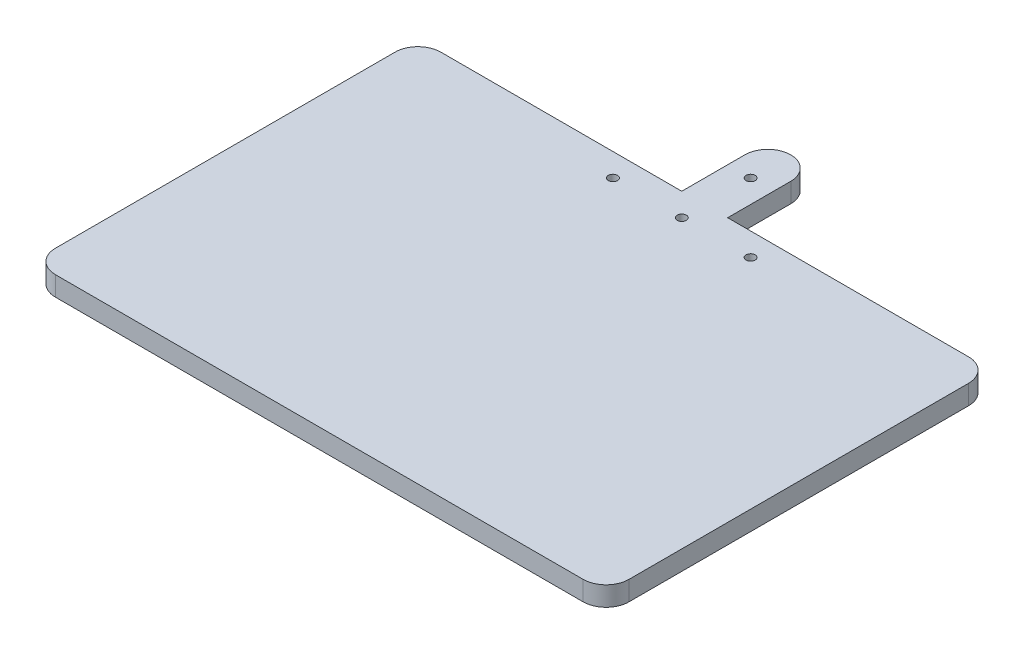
ISO-10303-21;
HEADER;
FILE_DESCRIPTION(('STEP AP214'),'2;1');
FILE_NAME('part.step','',(''),(''),'','','');
FILE_SCHEMA(('AUTOMOTIVE_DESIGN { 1 0 10303 214 1 1 1 1 }'));
ENDSEC;
DATA;
#1=APPLICATION_CONTEXT('core data for automotive mechanical design processes');
#2=APPLICATION_PROTOCOL_DEFINITION('international standard','automotive_design',2000,#1);
#3=PRODUCT_CONTEXT('',#1,'mechanical');
#4=PRODUCT('Part','Part','',(#3));
#5=PRODUCT_RELATED_PRODUCT_CATEGORY('part','',(#4));
#6=PRODUCT_DEFINITION_FORMATION('','',#4);
#7=PRODUCT_DEFINITION_CONTEXT('part definition',#1,'design');
#8=PRODUCT_DEFINITION('design','',#6,#7);
#9=PRODUCT_DEFINITION_SHAPE('','',#8);
#10=(LENGTH_UNIT() NAMED_UNIT(*) SI_UNIT(.MILLI.,.METRE.));
#11=(NAMED_UNIT(*) PLANE_ANGLE_UNIT() SI_UNIT($,.RADIAN.));
#12=(NAMED_UNIT(*) SI_UNIT($,.STERADIAN.) SOLID_ANGLE_UNIT());
#13=UNCERTAINTY_MEASURE_WITH_UNIT(LENGTH_MEASURE(1.E-05),#10,'distance_accuracy_value','');
#14=(GEOMETRIC_REPRESENTATION_CONTEXT(3) GLOBAL_UNCERTAINTY_ASSIGNED_CONTEXT((#13)) GLOBAL_UNIT_ASSIGNED_CONTEXT((#10,
#11,#12)) REPRESENTATION_CONTEXT('',''));
#15=CARTESIAN_POINT('',(0.,0.,0.));
#16=DIRECTION('',(0.,0.,1.));
#17=DIRECTION('',(1.,0.,0.));
#18=AXIS2_PLACEMENT_3D('',#15,#16,#17);
#19=CARTESIAN_POINT('',(0.,-8.5,-87.4904896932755));
#20=DIRECTION('',(0.,-1.,0.));
#21=DIRECTION('',(0.,0.,-1.));
#22=AXIS2_PLACEMENT_3D('',#19,#20,#21);
#23=CYLINDRICAL_SURFACE('',#22,1.99999999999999);
#24=CARTESIAN_POINT('',(0.,0.,-87.4904896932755));
#25=DIRECTION('',(0.,-1.,0.));
#26=DIRECTION('',(0.,0.,-1.));
#27=AXIS2_PLACEMENT_3D('',#24,#25,#26);
#28=CIRCLE('',#27,2.);
#29=CARTESIAN_POINT('',(0.,0.,-89.4904896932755));
#30=VERTEX_POINT('',#29);
#31=EDGE_CURVE('E184',#30,#30,#28,.T.);
#32=ORIENTED_EDGE('',*,*,#31,.F.);
#33=EDGE_LOOP('',(#32));
#34=FACE_BOUND('',#33,.T.);
#35=CARTESIAN_POINT('',(0.,-6.00000000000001,-87.4904896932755));
#36=DIRECTION('',(0.,-1.,0.));
#37=DIRECTION('',(0.,0.,-1.));
#38=AXIS2_PLACEMENT_3D('',#35,#36,#37);
#39=CIRCLE('',#38,1.99999999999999);
#40=CARTESIAN_POINT('',(0.,-6.00000000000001,-89.4904896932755));
#41=VERTEX_POINT('',#40);
#42=EDGE_CURVE('E74',#41,#41,#39,.F.);
#43=ORIENTED_EDGE('',*,*,#42,.F.);
#44=EDGE_LOOP('',(#43));
#45=FACE_BOUND('',#44,.T.);
#46=ADVANCED_FACE('F70',(#34,#45),#23,.F.);
#47=CARTESIAN_POINT('',(30.,-8.5,-57.4904896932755));
#48=DIRECTION('',(0.,-1.,0.));
#49=DIRECTION('',(0.,0.,-1.));
#50=AXIS2_PLACEMENT_3D('',#47,#48,#49);
#51=CYLINDRICAL_SURFACE('',#50,1.99999999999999);
#52=CARTESIAN_POINT('',(30.,0.,-57.4904896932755));
#53=DIRECTION('',(0.,-1.,0.));
#54=DIRECTION('',(0.,0.,-1.));
#55=AXIS2_PLACEMENT_3D('',#52,#53,#54);
#56=CIRCLE('',#55,1.99999999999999);
#57=CARTESIAN_POINT('',(30.,0.,-59.4904896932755));
#58=VERTEX_POINT('',#57);
#59=EDGE_CURVE('E280',#58,#58,#56,.T.);
#60=ORIENTED_EDGE('',*,*,#59,.F.);
#61=EDGE_LOOP('',(#60));
#62=FACE_BOUND('',#61,.T.);
#63=CARTESIAN_POINT('',(30.,-6.00000000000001,-57.4904896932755));
#64=DIRECTION('',(0.,-1.,0.));
#65=DIRECTION('',(0.,0.,-1.));
#66=AXIS2_PLACEMENT_3D('',#63,#64,#65);
#67=CIRCLE('',#66,1.99999999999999);
#68=CARTESIAN_POINT('',(30.,-6.00000000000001,-59.4904896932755));
#69=VERTEX_POINT('',#68);
#70=EDGE_CURVE('E266',#69,#69,#67,.F.);
#71=ORIENTED_EDGE('',*,*,#70,.F.);
#72=EDGE_LOOP('',(#71));
#73=FACE_BOUND('',#72,.T.);
#74=ADVANCED_FACE('F294',(#62,#73),#51,.F.);
#75=CARTESIAN_POINT('',(0.,-8.5,-57.4904896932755));
#76=DIRECTION('',(0.,-1.,0.));
#77=DIRECTION('',(0.,0.,-1.));
#78=AXIS2_PLACEMENT_3D('',#75,#76,#77);
#79=CYLINDRICAL_SURFACE('',#78,1.99999999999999);
#80=CARTESIAN_POINT('',(0.,0.,-57.4904896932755));
#81=DIRECTION('',(0.,-1.,0.));
#82=DIRECTION('',(0.,0.,-1.));
#83=AXIS2_PLACEMENT_3D('',#80,#81,#82);
#84=CIRCLE('',#83,2.);
#85=CARTESIAN_POINT('',(0.,0.,-59.4904896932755));
#86=VERTEX_POINT('',#85);
#87=EDGE_CURVE('E275',#86,#86,#84,.T.);
#88=ORIENTED_EDGE('',*,*,#87,.F.);
#89=EDGE_LOOP('',(#88));
#90=FACE_BOUND('',#89,.T.);
#91=CARTESIAN_POINT('',(0.,-6.00000000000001,-57.4904896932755));
#92=DIRECTION('',(0.,-1.,0.));
#93=DIRECTION('',(0.,0.,-1.));
#94=AXIS2_PLACEMENT_3D('',#91,#92,#93);
#95=CIRCLE('',#94,1.99999999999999);
#96=CARTESIAN_POINT('',(0.,-6.00000000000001,-59.4904896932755));
#97=VERTEX_POINT('',#96);
#98=EDGE_CURVE('E263',#97,#97,#95,.F.);
#99=ORIENTED_EDGE('',*,*,#98,.F.);
#100=EDGE_LOOP('',(#99));
#101=FACE_BOUND('',#100,.T.);
#102=ADVANCED_FACE('F299',(#90,#101),#79,.F.);
#103=CARTESIAN_POINT('',(-30.,-8.5,-57.4904896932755));
#104=DIRECTION('',(0.,-1.,0.));
#105=DIRECTION('',(0.,0.,-1.));
#106=AXIS2_PLACEMENT_3D('',#103,#104,#105);
#107=CYLINDRICAL_SURFACE('',#106,1.99999999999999);
#108=CARTESIAN_POINT('',(-30.,0.,-57.4904896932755));
#109=DIRECTION('',(0.,-1.,0.));
#110=DIRECTION('',(0.,0.,-1.));
#111=AXIS2_PLACEMENT_3D('',#108,#109,#110);
#112=CIRCLE('',#111,2.);
#113=CARTESIAN_POINT('',(-30.,0.,-59.4904896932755));
#114=VERTEX_POINT('',#113);
#115=EDGE_CURVE('E271',#114,#114,#112,.T.);
#116=ORIENTED_EDGE('',*,*,#115,.F.);
#117=EDGE_LOOP('',(#116));
#118=FACE_BOUND('',#117,.T.);
#119=CARTESIAN_POINT('',(-30.,-6.00000000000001,-57.4904896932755));
#120=DIRECTION('',(0.,-1.,0.));
#121=DIRECTION('',(0.,0.,-1.));
#122=AXIS2_PLACEMENT_3D('',#119,#120,#121);
#123=CIRCLE('',#122,1.99999999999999);
#124=CARTESIAN_POINT('',(-30.,-6.00000000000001,-59.4904896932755));
#125=VERTEX_POINT('',#124);
#126=EDGE_CURVE('E260',#125,#125,#123,.F.);
#127=ORIENTED_EDGE('',*,*,#126,.F.);
#128=EDGE_LOOP('',(#127));
#129=FACE_BOUND('',#128,.T.);
#130=ADVANCED_FACE('F324',(#118,#129),#107,.F.);
#131=CARTESIAN_POINT('',(-115.,-309.704249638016,-67.4904896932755));
#132=DIRECTION('',(0.,0.,-1.));
#133=DIRECTION('',(-1.,0.,0.));
#134=AXIS2_PLACEMENT_3D('',#131,#132,#133);
#135=PLANE('',#134);
#136=DIRECTION('',(1.,0.,0.));
#137=VECTOR('',#136,1.);
#138=CARTESIAN_POINT('',(-115.,-8.50000000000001,-67.4904896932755));
#139=LINE('',#138,#137);
#140=CARTESIAN_POINT('',(10.,-8.50000000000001,-67.4904896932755));
#141=VERTEX_POINT('',#140);
#142=CARTESIAN_POINT('',(115.,-8.50000000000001,-67.4904896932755));
#143=VERTEX_POINT('',#142);
#144=EDGE_CURVE('E188',#141,#143,#139,.T.);
#145=ORIENTED_EDGE('',*,*,#144,.F.);
#146=DIRECTION('',(0.,-1.,0.));
#147=VECTOR('',#146,1.);
#148=CARTESIAN_POINT('',(10.,0.,-67.4904896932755));
#149=LINE('',#148,#147);
#150=CARTESIAN_POINT('',(9.99999999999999,0.,-67.4904896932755));
#151=VERTEX_POINT('',#150);
#152=EDGE_CURVE('E181',#151,#141,#149,.T.);
#153=ORIENTED_EDGE('',*,*,#152,.F.);
#154=DIRECTION('',(-1.,0.,0.));
#155=VECTOR('',#154,1.);
#156=CARTESIAN_POINT('',(-115.,0.,-67.4904896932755));
#157=LINE('',#156,#155);
#158=CARTESIAN_POINT('',(115.,0.,-67.4904896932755));
#159=VERTEX_POINT('',#158);
#160=EDGE_CURVE('E163',#159,#151,#157,.T.);
#161=ORIENTED_EDGE('',*,*,#160,.F.);
#162=DIRECTION('',(0.,1.,0.));
#163=VECTOR('',#162,1.);
#164=CARTESIAN_POINT('',(115.,-309.704249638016,-67.4904896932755));
#165=LINE('',#164,#163);
#166=EDGE_CURVE('E242',#143,#159,#165,.T.);
#167=ORIENTED_EDGE('',*,*,#166,.F.);
#168=EDGE_LOOP('',(#145,#153,#161,#167));
#169=FACE_BOUND('',#168,.T.);
#170=ADVANCED_FACE('F187',(#169),#135,.T.);
#171=CARTESIAN_POINT('',(-10.,0.,-67.4904896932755));
#172=VERTEX_POINT('',#171);
#173=CARTESIAN_POINT('',(-115.,0.,-67.4904896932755));
#174=VERTEX_POINT('',#173);
#175=EDGE_CURVE('E175',#172,#174,#157,.T.);
#176=ORIENTED_EDGE('',*,*,#175,.F.);
#177=DIRECTION('',(0.,1.,0.));
#178=VECTOR('',#177,1.);
#179=CARTESIAN_POINT('',(-10.,0.,-67.4904896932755));
#180=LINE('',#179,#178);
#181=CARTESIAN_POINT('',(-9.99999999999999,-8.50000000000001,-67.4904896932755));
#182=VERTEX_POINT('',#181);
#183=EDGE_CURVE('E189',#182,#172,#180,.T.);
#184=ORIENTED_EDGE('',*,*,#183,.F.);
#185=CARTESIAN_POINT('',(-115.,-8.50000000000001,-67.4904896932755));
#186=VERTEX_POINT('',#185);
#187=EDGE_CURVE('E209',#186,#182,#139,.T.);
#188=ORIENTED_EDGE('',*,*,#187,.F.);
#189=DIRECTION('',(0.,1.,0.));
#190=VECTOR('',#189,1.);
#191=CARTESIAN_POINT('',(-115.,-309.704249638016,-67.4904896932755));
#192=LINE('',#191,#190);
#193=EDGE_CURVE('E239',#186,#174,#192,.T.);
#194=ORIENTED_EDGE('',*,*,#193,.T.);
#195=EDGE_LOOP('',(#176,#184,#188,#194));
#196=FACE_BOUND('',#195,.T.);
#197=ADVANCED_FACE('F323',(#196),#135,.T.);
#198=CARTESIAN_POINT('',(12.5,0.,-47.49));
#199=DIRECTION('',(0.,-1.,0.));
#200=DIRECTION('',(0.,0.,-1.));
#201=AXIS2_PLACEMENT_3D('',#198,#199,#200);
#202=PLANE('',#201);
#203=ORIENTED_EDGE('',*,*,#115,.T.);
#204=EDGE_LOOP('',(#203));
#205=FACE_BOUND('',#204,.T.);
#206=ORIENTED_EDGE('',*,*,#87,.T.);
#207=EDGE_LOOP('',(#206));
#208=FACE_BOUND('',#207,.T.);
#209=ORIENTED_EDGE('',*,*,#59,.T.);
#210=EDGE_LOOP('',(#209));
#211=FACE_BOUND('',#210,.T.);
#212=ORIENTED_EDGE('',*,*,#31,.T.);
#213=EDGE_LOOP('',(#212));
#214=FACE_BOUND('',#213,.T.);
#215=ORIENTED_EDGE('',*,*,#160,.T.);
#216=DIRECTION('',(0.,0.,1.));
#217=VECTOR('',#216,1.);
#218=CARTESIAN_POINT('',(9.99999999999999,0.,-110.49));
#219=LINE('',#218,#217);
#220=CARTESIAN_POINT('',(9.99999999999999,0.,-94.9904896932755));
#221=VERTEX_POINT('',#220);
#222=EDGE_CURVE('E166',#221,#151,#219,.T.);
#223=ORIENTED_EDGE('',*,*,#222,.F.);
#224=CARTESIAN_POINT('',(0.,0.,-94.9904896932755));
#225=DIRECTION('',(0.,-1.,0.));
#226=DIRECTION('',(1.,0.,0.));
#227=AXIS2_PLACEMENT_3D('',#224,#225,#226);
#228=CIRCLE('',#227,10.);
#229=CARTESIAN_POINT('',(0.,0.,-104.990489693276));
#230=VERTEX_POINT('',#229);
#231=EDGE_CURVE('E79',#221,#230,#228,.F.);
#232=ORIENTED_EDGE('',*,*,#231,.T.);
#233=CARTESIAN_POINT('',(0.,0.,-94.9904896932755));
#234=DIRECTION('',(0.,-1.,0.));
#235=DIRECTION('',(1.,0.,0.));
#236=AXIS2_PLACEMENT_3D('',#233,#234,#235);
#237=CIRCLE('',#236,10.);
#238=CARTESIAN_POINT('',(-10.,0.,-94.9904896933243));
#239=VERTEX_POINT('',#238);
#240=EDGE_CURVE('E257',#230,#239,#237,.F.);
#241=ORIENTED_EDGE('',*,*,#240,.T.);
#242=DIRECTION('',(0.,0.,-1.));
#243=VECTOR('',#242,1.);
#244=CARTESIAN_POINT('',(-10.,0.,-110.49));
#245=LINE('',#244,#243);
#246=EDGE_CURVE('E183',#172,#239,#245,.T.);
#247=ORIENTED_EDGE('',*,*,#246,.F.);
#248=ORIENTED_EDGE('',*,*,#175,.T.);
#249=CARTESIAN_POINT('',(-115.,0.,-57.4904896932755));
#250=DIRECTION('',(0.,1.,0.));
#251=DIRECTION('',(0.,0.,1.));
#252=AXIS2_PLACEMENT_3D('',#249,#250,#251);
#253=CIRCLE('',#252,9.99999999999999);
#254=CARTESIAN_POINT('',(-125.,0.,-57.4904896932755));
#255=VERTEX_POINT('',#254);
#256=EDGE_CURVE('E174',#174,#255,#253,.T.);
#257=ORIENTED_EDGE('',*,*,#256,.T.);
#258=DIRECTION('',(0.,0.,1.));
#259=VECTOR('',#258,1.);
#260=CARTESIAN_POINT('',(-125.,0.,-57.4904896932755));
#261=LINE('',#260,#259);
#262=CARTESIAN_POINT('',(-125.,0.,90.5095103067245));
#263=VERTEX_POINT('',#262);
#264=EDGE_CURVE('E232',#255,#263,#261,.T.);
#265=ORIENTED_EDGE('',*,*,#264,.T.);
#266=CARTESIAN_POINT('',(-115.,0.,90.5095103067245));
#267=DIRECTION('',(0.,1.,0.));
#268=DIRECTION('',(0.,0.,1.));
#269=AXIS2_PLACEMENT_3D('',#266,#267,#268);
#270=CIRCLE('',#269,9.99999999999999);
#271=CARTESIAN_POINT('',(-115.,0.,100.509510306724));
#272=VERTEX_POINT('',#271);
#273=EDGE_CURVE('E201',#263,#272,#270,.T.);
#274=ORIENTED_EDGE('',*,*,#273,.T.);
#275=DIRECTION('',(1.,0.,0.));
#276=VECTOR('',#275,1.);
#277=CARTESIAN_POINT('',(-115.,0.,100.509510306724));
#278=LINE('',#277,#276);
#279=CARTESIAN_POINT('',(115.,0.,100.509510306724));
#280=VERTEX_POINT('',#279);
#281=EDGE_CURVE('E221',#272,#280,#278,.T.);
#282=ORIENTED_EDGE('',*,*,#281,.T.);
#283=CARTESIAN_POINT('',(115.,0.,90.5095103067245));
#284=DIRECTION('',(0.,1.,0.));
#285=DIRECTION('',(0.,0.,1.));
#286=AXIS2_PLACEMENT_3D('',#283,#284,#285);
#287=CIRCLE('',#286,9.99999999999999);
#288=CARTESIAN_POINT('',(125.,0.,90.5095103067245));
#289=VERTEX_POINT('',#288);
#290=EDGE_CURVE('E224',#280,#289,#287,.T.);
#291=ORIENTED_EDGE('',*,*,#290,.T.);
#292=DIRECTION('',(0.,0.,-1.));
#293=VECTOR('',#292,1.);
#294=CARTESIAN_POINT('',(125.,0.,-57.4904896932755));
#295=LINE('',#294,#293);
#296=CARTESIAN_POINT('',(125.,0.,-57.4904896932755));
#297=VERTEX_POINT('',#296);
#298=EDGE_CURVE('E227',#289,#297,#295,.T.);
#299=ORIENTED_EDGE('',*,*,#298,.T.);
#300=CARTESIAN_POINT('',(115.,0.,-57.4904896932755));
#301=DIRECTION('',(0.,1.,0.));
#302=DIRECTION('',(0.,0.,-1.));
#303=AXIS2_PLACEMENT_3D('',#300,#301,#302);
#304=CIRCLE('',#303,9.99999999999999);
#305=EDGE_CURVE('E170',#297,#159,#304,.T.);
#306=ORIENTED_EDGE('',*,*,#305,.T.);
#307=EDGE_LOOP('',(#215,#223,#232,#241,#247,#248,#257,#265,#274,#282,#291,#299,#306));
#308=FACE_BOUND('',#307,.T.);
#309=ADVANCED_FACE('F165',(#205,#208,#211,#214,#308),#202,.F.);
#310=CARTESIAN_POINT('',(-115.,-309.704249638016,90.5095103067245));
#311=DIRECTION('',(0.,1.,0.));
#312=DIRECTION('',(0.,0.,1.));
#313=AXIS2_PLACEMENT_3D('',#310,#311,#312);
#314=CYLINDRICAL_SURFACE('',#313,9.99999999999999);
#315=CARTESIAN_POINT('',(-115.,-8.50000000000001,90.5095103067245));
#316=DIRECTION('',(0.,1.,0.));
#317=DIRECTION('',(0.,0.,1.));
#318=AXIS2_PLACEMENT_3D('',#315,#316,#317);
#319=CIRCLE('',#318,9.99999999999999);
#320=CARTESIAN_POINT('',(-115.,-8.50000000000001,100.509510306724));
#321=VERTEX_POINT('',#320);
#322=CARTESIAN_POINT('',(-125.,-8.50000000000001,90.5095103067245));
#323=VERTEX_POINT('',#322);
#324=EDGE_CURVE('E216',#321,#323,#319,.F.);
#325=ORIENTED_EDGE('',*,*,#324,.F.);
#326=DIRECTION('',(0.,1.,0.));
#327=VECTOR('',#326,1.);
#328=CARTESIAN_POINT('',(-115.,-309.704249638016,100.509510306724));
#329=LINE('',#328,#327);
#330=EDGE_CURVE('E235',#321,#272,#329,.T.);
#331=ORIENTED_EDGE('',*,*,#330,.T.);
#332=ORIENTED_EDGE('',*,*,#273,.F.);
#333=DIRECTION('',(0.,1.,0.));
#334=VECTOR('',#333,1.);
#335=CARTESIAN_POINT('',(-125.,-309.704249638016,90.5095103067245));
#336=LINE('',#335,#334);
#337=EDGE_CURVE('E205',#323,#263,#336,.T.);
#338=ORIENTED_EDGE('',*,*,#337,.F.);
#339=EDGE_LOOP('',(#325,#331,#332,#338));
#340=FACE_BOUND('',#339,.T.);
#341=ADVANCED_FACE('F315',(#340),#314,.T.);
#342=CARTESIAN_POINT('',(-125.,-309.704249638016,-57.4904896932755));
#343=DIRECTION('',(-1.,0.,0.));
#344=DIRECTION('',(0.,0.,1.));
#345=AXIS2_PLACEMENT_3D('',#342,#343,#344);
#346=PLANE('',#345);
#347=DIRECTION('',(0.,0.,-1.));
#348=VECTOR('',#347,1.);
#349=CARTESIAN_POINT('',(-125.,-8.50000000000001,-57.4904896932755));
#350=LINE('',#349,#348);
#351=CARTESIAN_POINT('',(-125.,-8.50000000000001,-57.4904896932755));
#352=VERTEX_POINT('',#351);
#353=EDGE_CURVE('E214',#323,#352,#350,.T.);
#354=ORIENTED_EDGE('',*,*,#353,.F.);
#355=ORIENTED_EDGE('',*,*,#337,.T.);
#356=ORIENTED_EDGE('',*,*,#264,.F.);
#357=DIRECTION('',(0.,1.,0.));
#358=VECTOR('',#357,1.);
#359=CARTESIAN_POINT('',(-125.,-309.704249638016,-57.4904896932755));
#360=LINE('',#359,#358);
#361=EDGE_CURVE('E237',#352,#255,#360,.T.);
#362=ORIENTED_EDGE('',*,*,#361,.F.);
#363=EDGE_LOOP('',(#354,#355,#356,#362));
#364=FACE_BOUND('',#363,.T.);
#365=ADVANCED_FACE('F311',(#364),#346,.T.);
#366=CARTESIAN_POINT('',(-115.,-309.704249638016,-57.4904896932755));
#367=DIRECTION('',(0.,1.,0.));
#368=DIRECTION('',(0.,0.,1.));
#369=AXIS2_PLACEMENT_3D('',#366,#367,#368);
#370=CYLINDRICAL_SURFACE('',#369,9.99999999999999);
#371=CARTESIAN_POINT('',(-115.,-8.50000000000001,-57.4904896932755));
#372=DIRECTION('',(0.,1.,0.));
#373=DIRECTION('',(0.,0.,1.));
#374=AXIS2_PLACEMENT_3D('',#371,#372,#373);
#375=CIRCLE('',#374,9.99999999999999);
#376=EDGE_CURVE('E212',#352,#186,#375,.F.);
#377=ORIENTED_EDGE('',*,*,#376,.F.);
#378=ORIENTED_EDGE('',*,*,#361,.T.);
#379=ORIENTED_EDGE('',*,*,#256,.F.);
#380=ORIENTED_EDGE('',*,*,#193,.F.);
#381=EDGE_LOOP('',(#377,#378,#379,#380));
#382=FACE_BOUND('',#381,.T.);
#383=ADVANCED_FACE('F314',(#382),#370,.T.);
#384=CARTESIAN_POINT('',(115.,-309.704249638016,-57.4904896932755));
#385=DIRECTION('',(0.,1.,0.));
#386=DIRECTION('',(0.,0.,1.));
#387=AXIS2_PLACEMENT_3D('',#384,#385,#386);
#388=CYLINDRICAL_SURFACE('',#387,9.99999999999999);
#389=CARTESIAN_POINT('',(115.,-8.50000000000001,-57.4904896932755));
#390=DIRECTION('',(0.,1.,0.));
#391=DIRECTION('',(0.,0.,1.));
#392=AXIS2_PLACEMENT_3D('',#389,#390,#391);
#393=CIRCLE('',#392,9.99999999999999);
#394=CARTESIAN_POINT('',(125.,-8.50000000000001,-57.4904896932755));
#395=VERTEX_POINT('',#394);
#396=EDGE_CURVE('E207',#143,#395,#393,.F.);
#397=ORIENTED_EDGE('',*,*,#396,.F.);
#398=ORIENTED_EDGE('',*,*,#166,.T.);
#399=ORIENTED_EDGE('',*,*,#305,.F.);
#400=DIRECTION('',(0.,1.,0.));
#401=VECTOR('',#400,1.);
#402=CARTESIAN_POINT('',(125.,-309.704249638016,-57.4904896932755));
#403=LINE('',#402,#401);
#404=EDGE_CURVE('E244',#395,#297,#403,.T.);
#405=ORIENTED_EDGE('',*,*,#404,.F.);
#406=EDGE_LOOP('',(#397,#398,#399,#405));
#407=FACE_BOUND('',#406,.T.);
#408=ADVANCED_FACE('F319',(#407),#388,.T.);
#409=CARTESIAN_POINT('',(125.,-309.704249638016,-57.4904896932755));
#410=DIRECTION('',(1.,0.,0.));
#411=DIRECTION('',(0.,0.,-1.));
#412=AXIS2_PLACEMENT_3D('',#409,#410,#411);
#413=PLANE('',#412);
#414=DIRECTION('',(0.,0.,1.));
#415=VECTOR('',#414,1.);
#416=CARTESIAN_POINT('',(125.,-8.50000000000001,-57.4904896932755));
#417=LINE('',#416,#415);
#418=CARTESIAN_POINT('',(125.,-8.50000000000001,90.5095103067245));
#419=VERTEX_POINT('',#418);
#420=EDGE_CURVE('E204',#395,#419,#417,.T.);
#421=ORIENTED_EDGE('',*,*,#420,.F.);
#422=ORIENTED_EDGE('',*,*,#404,.T.);
#423=ORIENTED_EDGE('',*,*,#298,.F.);
#424=DIRECTION('',(0.,1.,0.));
#425=VECTOR('',#424,1.);
#426=CARTESIAN_POINT('',(125.,-309.704249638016,90.5095103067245));
#427=LINE('',#426,#425);
#428=EDGE_CURVE('E246',#419,#289,#427,.T.);
#429=ORIENTED_EDGE('',*,*,#428,.F.);
#430=EDGE_LOOP('',(#421,#422,#423,#429));
#431=FACE_BOUND('',#430,.T.);
#432=ADVANCED_FACE('F327',(#431),#413,.T.);
#433=CARTESIAN_POINT('',(115.,-309.704249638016,90.5095103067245));
#434=DIRECTION('',(0.,1.,0.));
#435=DIRECTION('',(0.,0.,1.));
#436=AXIS2_PLACEMENT_3D('',#433,#434,#435);
#437=CYLINDRICAL_SURFACE('',#436,9.99999999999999);
#438=CARTESIAN_POINT('',(115.,-8.50000000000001,90.5095103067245));
#439=DIRECTION('',(0.,1.,0.));
#440=DIRECTION('',(0.,0.,1.));
#441=AXIS2_PLACEMENT_3D('',#438,#439,#440);
#442=CIRCLE('',#441,9.99999999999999);
#443=CARTESIAN_POINT('',(115.,-8.50000000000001,100.509510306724));
#444=VERTEX_POINT('',#443);
#445=EDGE_CURVE('E202',#419,#444,#442,.F.);
#446=ORIENTED_EDGE('',*,*,#445,.F.);
#447=ORIENTED_EDGE('',*,*,#428,.T.);
#448=ORIENTED_EDGE('',*,*,#290,.F.);
#449=DIRECTION('',(0.,1.,0.));
#450=VECTOR('',#449,1.);
#451=CARTESIAN_POINT('',(115.,-309.704249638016,100.509510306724));
#452=LINE('',#451,#450);
#453=EDGE_CURVE('E248',#444,#280,#452,.T.);
#454=ORIENTED_EDGE('',*,*,#453,.F.);
#455=EDGE_LOOP('',(#446,#447,#448,#454));
#456=FACE_BOUND('',#455,.T.);
#457=ADVANCED_FACE('F331',(#456),#437,.T.);
#458=CARTESIAN_POINT('',(-115.,-309.704249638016,100.509510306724));
#459=DIRECTION('',(0.,0.,1.));
#460=DIRECTION('',(1.,0.,0.));
#461=AXIS2_PLACEMENT_3D('',#458,#459,#460);
#462=PLANE('',#461);
#463=DIRECTION('',(-1.,0.,0.));
#464=VECTOR('',#463,1.);
#465=CARTESIAN_POINT('',(-115.,-8.50000000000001,100.509510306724));
#466=LINE('',#465,#464);
#467=EDGE_CURVE('E218',#444,#321,#466,.T.);
#468=ORIENTED_EDGE('',*,*,#467,.F.);
#469=ORIENTED_EDGE('',*,*,#453,.T.);
#470=ORIENTED_EDGE('',*,*,#281,.F.);
#471=ORIENTED_EDGE('',*,*,#330,.F.);
#472=EDGE_LOOP('',(#468,#469,#470,#471));
#473=FACE_BOUND('',#472,.T.);
#474=ADVANCED_FACE('F335',(#473),#462,.T.);
#475=CARTESIAN_POINT('',(12.5,-8.50000000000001,0.));
#476=DIRECTION('',(0.,1.,0.));
#477=DIRECTION('',(0.,0.,1.));
#478=AXIS2_PLACEMENT_3D('',#475,#476,#477);
#479=PLANE('',#478);
#480=CARTESIAN_POINT('',(0.,-8.50000000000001,-87.4904896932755));
#481=DIRECTION('',(0.,-1.,0.));
#482=DIRECTION('',(0.,0.,-1.));
#483=AXIS2_PLACEMENT_3D('',#480,#481,#482);
#484=CIRCLE('',#483,4.);
#485=CARTESIAN_POINT('',(0.,-8.50000000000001,-91.4904896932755));
#486=VERTEX_POINT('',#485);
#487=EDGE_CURVE('E568',#486,#486,#484,.T.);
#488=ORIENTED_EDGE('',*,*,#487,.F.);
#489=EDGE_LOOP('',(#488));
#490=FACE_BOUND('',#489,.T.);
#491=CARTESIAN_POINT('',(30.,-8.50000000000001,-57.4904896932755));
#492=DIRECTION('',(0.,-1.,0.));
#493=DIRECTION('',(0.,0.,-1.));
#494=AXIS2_PLACEMENT_3D('',#491,#492,#493);
#495=CIRCLE('',#494,4.00000000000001);
#496=CARTESIAN_POINT('',(30.,-8.50000000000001,-61.4904896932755));
#497=VERTEX_POINT('',#496);
#498=EDGE_CURVE('E570',#497,#497,#495,.T.);
#499=ORIENTED_EDGE('',*,*,#498,.F.);
#500=EDGE_LOOP('',(#499));
#501=FACE_BOUND('',#500,.T.);
#502=CARTESIAN_POINT('',(-30.,-8.50000000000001,-57.4904896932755));
#503=DIRECTION('',(0.,-1.,0.));
#504=DIRECTION('',(0.,0.,-1.));
#505=AXIS2_PLACEMENT_3D('',#502,#503,#504);
#506=CIRCLE('',#505,4.);
#507=CARTESIAN_POINT('',(-30.,-8.50000000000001,-61.4904896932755));
#508=VERTEX_POINT('',#507);
#509=EDGE_CURVE('E580',#508,#508,#506,.T.);
#510=ORIENTED_EDGE('',*,*,#509,.F.);
#511=EDGE_LOOP('',(#510));
#512=FACE_BOUND('',#511,.T.);
#513=CARTESIAN_POINT('',(0.,-8.50000000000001,-57.4904896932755));
#514=DIRECTION('',(0.,-1.,0.));
#515=DIRECTION('',(0.,0.,-1.));
#516=AXIS2_PLACEMENT_3D('',#513,#514,#515);
#517=CIRCLE('',#516,4.);
#518=CARTESIAN_POINT('',(0.,-8.50000000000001,-61.4904896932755));
#519=VERTEX_POINT('',#518);
#520=EDGE_CURVE('E283',#519,#519,#517,.T.);
#521=ORIENTED_EDGE('',*,*,#520,.F.);
#522=EDGE_LOOP('',(#521));
#523=FACE_BOUND('',#522,.T.);
#524=CARTESIAN_POINT('',(0.,-8.50000000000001,-94.9904896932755));
#525=DIRECTION('',(0.,1.,0.));
#526=DIRECTION('',(0.,0.,1.));
#527=AXIS2_PLACEMENT_3D('',#524,#525,#526);
#528=CIRCLE('',#527,10.);
#529=CARTESIAN_POINT('',(-10.,-8.50000000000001,-94.9904896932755));
#530=VERTEX_POINT('',#529);
#531=CARTESIAN_POINT('',(0.,-8.50000000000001,-104.990489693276));
#532=VERTEX_POINT('',#531);
#533=EDGE_CURVE('E252',#530,#532,#528,.F.);
#534=ORIENTED_EDGE('',*,*,#533,.T.);
#535=CARTESIAN_POINT('',(0.,-8.50000000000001,-94.9904896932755));
#536=DIRECTION('',(0.,1.,0.));
#537=DIRECTION('',(0.,0.,1.));
#538=AXIS2_PLACEMENT_3D('',#535,#536,#537);
#539=CIRCLE('',#538,10.);
#540=CARTESIAN_POINT('',(10.,-8.50000000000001,-94.9904896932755));
#541=VERTEX_POINT('',#540);
#542=EDGE_CURVE('E254',#532,#541,#539,.F.);
#543=ORIENTED_EDGE('',*,*,#542,.T.);
#544=DIRECTION('',(0.,0.,1.));
#545=VECTOR('',#544,1.);
#546=CARTESIAN_POINT('',(10.,-8.50000000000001,-104.990489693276));
#547=LINE('',#546,#545);
#548=EDGE_CURVE('E199',#541,#141,#547,.T.);
#549=ORIENTED_EDGE('',*,*,#548,.T.);
#550=ORIENTED_EDGE('',*,*,#144,.T.);
#551=ORIENTED_EDGE('',*,*,#396,.T.);
#552=ORIENTED_EDGE('',*,*,#420,.T.);
#553=ORIENTED_EDGE('',*,*,#445,.T.);
#554=ORIENTED_EDGE('',*,*,#467,.T.);
#555=ORIENTED_EDGE('',*,*,#324,.T.);
#556=ORIENTED_EDGE('',*,*,#353,.T.);
#557=ORIENTED_EDGE('',*,*,#376,.T.);
#558=ORIENTED_EDGE('',*,*,#187,.T.);
#559=DIRECTION('',(0.,0.,1.));
#560=VECTOR('',#559,1.);
#561=CARTESIAN_POINT('',(-10.,-8.50000000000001,-104.990489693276));
#562=LINE('',#561,#560);
#563=EDGE_CURVE('E193',#530,#182,#562,.T.);
#564=ORIENTED_EDGE('',*,*,#563,.F.);
#565=EDGE_LOOP('',(#534,#543,#549,#550,#551,#552,#553,#554,#555,#556,#557,#558,#564));
#566=FACE_BOUND('',#565,.T.);
#567=ADVANCED_FACE('F310',(#490,#501,#512,#523,#566),#479,.F.);
#568=CARTESIAN_POINT('',(10.,68.,-110.49));
#569=DIRECTION('',(-1.,0.,0.));
#570=DIRECTION('',(0.,-1.,0.));
#571=AXIS2_PLACEMENT_3D('',#568,#569,#570);
#572=PLANE('',#571);
#573=DIRECTION('',(0.,-1.,0.));
#574=VECTOR('',#573,1.);
#575=CARTESIAN_POINT('',(9.99999999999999,0.,-94.9904896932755));
#576=LINE('',#575,#574);
#577=EDGE_CURVE('E182',#541,#221,#576,.F.);
#578=ORIENTED_EDGE('',*,*,#577,.T.);
#579=ORIENTED_EDGE('',*,*,#222,.T.);
#580=ORIENTED_EDGE('',*,*,#152,.T.);
#581=ORIENTED_EDGE('',*,*,#548,.F.);
#582=EDGE_LOOP('',(#578,#579,#580,#581));
#583=FACE_BOUND('',#582,.T.);
#584=ADVANCED_FACE('F179',(#583),#572,.F.);
#585=CARTESIAN_POINT('',(-10.,68.,-110.49));
#586=DIRECTION('',(1.,0.,0.));
#587=DIRECTION('',(0.,1.,0.));
#588=AXIS2_PLACEMENT_3D('',#585,#586,#587);
#589=PLANE('',#588);
#590=ORIENTED_EDGE('',*,*,#183,.T.);
#591=ORIENTED_EDGE('',*,*,#246,.T.);
#592=DIRECTION('',(0.,1.,0.));
#593=VECTOR('',#592,1.);
#594=CARTESIAN_POINT('',(-10.,-8.50000000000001,-94.9904896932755));
#595=LINE('',#594,#593);
#596=EDGE_CURVE('E12',#239,#530,#595,.F.);
#597=ORIENTED_EDGE('',*,*,#596,.T.);
#598=ORIENTED_EDGE('',*,*,#563,.T.);
#599=EDGE_LOOP('',(#590,#591,#597,#598));
#600=FACE_BOUND('',#599,.T.);
#601=ADVANCED_FACE('F304',(#600),#589,.F.);
#602=CARTESIAN_POINT('',(0.,0.,-94.9904896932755));
#603=DIRECTION('',(0.,-1.,0.));
#604=DIRECTION('',(1.,0.,0.));
#605=AXIS2_PLACEMENT_3D('',#602,#603,#604);
#606=CYLINDRICAL_SURFACE('',#605,10.);
#607=ORIENTED_EDGE('',*,*,#596,.F.);
#608=ORIENTED_EDGE('',*,*,#240,.F.);
#609=DIRECTION('',(0.,1.,0.));
#610=VECTOR('',#609,1.);
#611=CARTESIAN_POINT('',(0.,0.,-104.990489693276));
#612=LINE('',#611,#610);
#613=EDGE_CURVE('E190',#532,#230,#612,.T.);
#614=ORIENTED_EDGE('',*,*,#613,.F.);
#615=ORIENTED_EDGE('',*,*,#533,.F.);
#616=EDGE_LOOP('',(#607,#608,#614,#615));
#617=FACE_BOUND('',#616,.T.);
#618=ADVANCED_FACE('F72',(#617),#606,.T.);
#619=CARTESIAN_POINT('',(0.,0.,-94.9904896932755));
#620=DIRECTION('',(0.,1.,0.));
#621=DIRECTION('',(-1.,0.,0.));
#622=AXIS2_PLACEMENT_3D('',#619,#620,#621);
#623=CYLINDRICAL_SURFACE('',#622,10.);
#624=ORIENTED_EDGE('',*,*,#231,.F.);
#625=ORIENTED_EDGE('',*,*,#577,.F.);
#626=ORIENTED_EDGE('',*,*,#542,.F.);
#627=ORIENTED_EDGE('',*,*,#613,.T.);
#628=EDGE_LOOP('',(#624,#625,#626,#627));
#629=FACE_BOUND('',#628,.T.);
#630=ADVANCED_FACE('F347',(#629),#623,.T.);
#631=CARTESIAN_POINT('',(-30.,-6.00000000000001,-57.4904896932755));
#632=DIRECTION('',(0.,-1.,0.));
#633=DIRECTION('',(0.,0.,-1.));
#634=AXIS2_PLACEMENT_3D('',#631,#632,#633);
#635=PLANE('',#634);
#636=CARTESIAN_POINT('',(-30.,-6.00000000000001,-57.4904896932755));
#637=DIRECTION('',(0.,-1.,0.));
#638=DIRECTION('',(0.,0.,-1.));
#639=AXIS2_PLACEMENT_3D('',#636,#637,#638);
#640=CIRCLE('',#639,4.);
#641=CARTESIAN_POINT('',(-30.,-6.00000000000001,-61.4904896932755));
#642=VERTEX_POINT('',#641);
#643=EDGE_CURVE('E576',#642,#642,#640,.T.);
#644=ORIENTED_EDGE('',*,*,#643,.T.);
#645=EDGE_LOOP('',(#644));
#646=FACE_BOUND('',#645,.T.);
#647=ORIENTED_EDGE('',*,*,#126,.T.);
#648=EDGE_LOOP('',(#647));
#649=FACE_BOUND('',#648,.T.);
#650=ADVANCED_FACE('F349',(#646,#649),#635,.T.);
#651=CARTESIAN_POINT('',(-30.,-6.00000000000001,-57.4904896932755));
#652=DIRECTION('',(0.,-1.,0.));
#653=DIRECTION('',(0.,0.,-1.));
#654=AXIS2_PLACEMENT_3D('',#651,#652,#653);
#655=CYLINDRICAL_SURFACE('',#654,4.);
#656=ORIENTED_EDGE('',*,*,#643,.F.);
#657=EDGE_LOOP('',(#656));
#658=FACE_BOUND('',#657,.T.);
#659=ORIENTED_EDGE('',*,*,#509,.T.);
#660=EDGE_LOOP('',(#659));
#661=FACE_BOUND('',#660,.T.);
#662=ADVANCED_FACE('F354',(#658,#661),#655,.F.);
#663=CARTESIAN_POINT('',(0.,-6.00000000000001,-57.4904896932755));
#664=DIRECTION('',(0.,-1.,0.));
#665=DIRECTION('',(0.,0.,-1.));
#666=AXIS2_PLACEMENT_3D('',#663,#664,#665);
#667=PLANE('',#666);
#668=CARTESIAN_POINT('',(0.,-6.00000000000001,-57.4904896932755));
#669=DIRECTION('',(0.,-1.,0.));
#670=DIRECTION('',(0.,0.,-1.));
#671=AXIS2_PLACEMENT_3D('',#668,#669,#670);
#672=CIRCLE('',#671,4.);
#673=CARTESIAN_POINT('',(0.,-6.00000000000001,-61.4904896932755));
#674=VERTEX_POINT('',#673);
#675=EDGE_CURVE('E264',#674,#674,#672,.T.);
#676=ORIENTED_EDGE('',*,*,#675,.T.);
#677=EDGE_LOOP('',(#676));
#678=FACE_BOUND('',#677,.T.);
#679=ORIENTED_EDGE('',*,*,#98,.T.);
#680=EDGE_LOOP('',(#679));
#681=FACE_BOUND('',#680,.T.);
#682=ADVANCED_FACE('F498',(#678,#681),#667,.T.);
#683=CARTESIAN_POINT('',(0.,-6.00000000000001,-57.4904896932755));
#684=DIRECTION('',(0.,-1.,0.));
#685=DIRECTION('',(0.,0.,-1.));
#686=AXIS2_PLACEMENT_3D('',#683,#684,#685);
#687=CYLINDRICAL_SURFACE('',#686,4.);
#688=ORIENTED_EDGE('',*,*,#675,.F.);
#689=EDGE_LOOP('',(#688));
#690=FACE_BOUND('',#689,.T.);
#691=ORIENTED_EDGE('',*,*,#520,.T.);
#692=EDGE_LOOP('',(#691));
#693=FACE_BOUND('',#692,.T.);
#694=ADVANCED_FACE('F507',(#690,#693),#687,.F.);
#695=CARTESIAN_POINT('',(30.,-6.00000000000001,-57.4904896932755));
#696=DIRECTION('',(0.,-1.,0.));
#697=DIRECTION('',(0.,0.,-1.));
#698=AXIS2_PLACEMENT_3D('',#695,#696,#697);
#699=PLANE('',#698);
#700=CARTESIAN_POINT('',(30.,-6.00000000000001,-57.4904896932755));
#701=DIRECTION('',(0.,-1.,0.));
#702=DIRECTION('',(0.,0.,-1.));
#703=AXIS2_PLACEMENT_3D('',#700,#701,#702);
#704=CIRCLE('',#703,4.00000000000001);
#705=CARTESIAN_POINT('',(30.,-6.00000000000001,-61.4904896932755));
#706=VERTEX_POINT('',#705);
#707=EDGE_CURVE('E584',#706,#706,#704,.T.);
#708=ORIENTED_EDGE('',*,*,#707,.T.);
#709=EDGE_LOOP('',(#708));
#710=FACE_BOUND('',#709,.T.);
#711=ORIENTED_EDGE('',*,*,#70,.T.);
#712=EDGE_LOOP('',(#711));
#713=FACE_BOUND('',#712,.T.);
#714=ADVANCED_FACE('F516',(#710,#713),#699,.T.);
#715=CARTESIAN_POINT('',(30.,-6.00000000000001,-57.4904896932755));
#716=DIRECTION('',(0.,-1.,0.));
#717=DIRECTION('',(0.,0.,-1.));
#718=AXIS2_PLACEMENT_3D('',#715,#716,#717);
#719=CYLINDRICAL_SURFACE('',#718,4.00000000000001);
#720=ORIENTED_EDGE('',*,*,#707,.F.);
#721=EDGE_LOOP('',(#720));
#722=FACE_BOUND('',#721,.T.);
#723=ORIENTED_EDGE('',*,*,#498,.T.);
#724=EDGE_LOOP('',(#723));
#725=FACE_BOUND('',#724,.T.);
#726=ADVANCED_FACE('F525',(#722,#725),#719,.F.);
#727=CARTESIAN_POINT('',(0.,-6.00000000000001,-87.4904896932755));
#728=DIRECTION('',(0.,-1.,0.));
#729=DIRECTION('',(0.,0.,-1.));
#730=AXIS2_PLACEMENT_3D('',#727,#728,#729);
#731=PLANE('',#730);
#732=CARTESIAN_POINT('',(0.,-6.00000000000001,-87.4904896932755));
#733=DIRECTION('',(0.,-1.,0.));
#734=DIRECTION('',(0.,0.,-1.));
#735=AXIS2_PLACEMENT_3D('',#732,#733,#734);
#736=CIRCLE('',#735,4.);
#737=CARTESIAN_POINT('',(0.,-6.00000000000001,-91.4904896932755));
#738=VERTEX_POINT('',#737);
#739=EDGE_CURVE('E565',#738,#738,#736,.T.);
#740=ORIENTED_EDGE('',*,*,#739,.T.);
#741=EDGE_LOOP('',(#740));
#742=FACE_BOUND('',#741,.T.);
#743=ORIENTED_EDGE('',*,*,#42,.T.);
#744=EDGE_LOOP('',(#743));
#745=FACE_BOUND('',#744,.T.);
#746=ADVANCED_FACE('F534',(#742,#745),#731,.T.);
#747=CARTESIAN_POINT('',(0.,-6.00000000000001,-87.4904896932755));
#748=DIRECTION('',(0.,-1.,0.));
#749=DIRECTION('',(0.,0.,-1.));
#750=AXIS2_PLACEMENT_3D('',#747,#748,#749);
#751=CYLINDRICAL_SURFACE('',#750,4.);
#752=ORIENTED_EDGE('',*,*,#739,.F.);
#753=EDGE_LOOP('',(#752));
#754=FACE_BOUND('',#753,.T.);
#755=ORIENTED_EDGE('',*,*,#487,.T.);
#756=EDGE_LOOP('',(#755));
#757=FACE_BOUND('',#756,.T.);
#758=ADVANCED_FACE('F543',(#754,#757),#751,.F.);
#759=CLOSED_SHELL('',(#46,#74,#102,#130,#170,#197,#309,#341,#365,#383,#408,#432,#457,#474,#567,
#584,#601,#618,#630,#650,#662,#682,#694,#714,#726,#746,#758));
#760=MANIFOLD_SOLID_BREP('B2',#759);
#761=ADVANCED_BREP_SHAPE_REPRESENTATION('',(#18,#760),#14);
#762=SHAPE_DEFINITION_REPRESENTATION(#9,#761);
ENDSEC;
END-ISO-10303-21;
